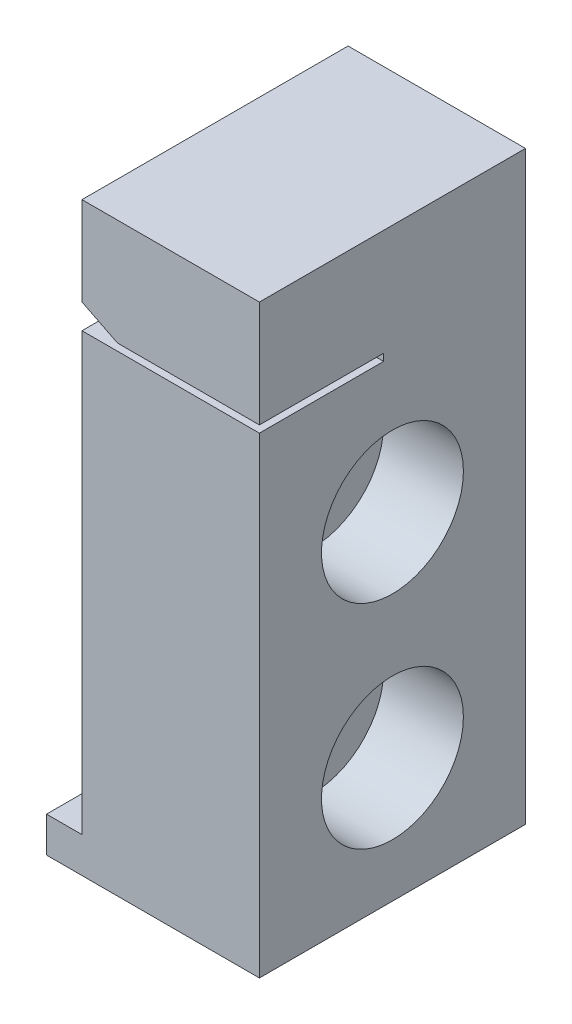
ISO-10303-21;
HEADER;
FILE_DESCRIPTION(('STEP AP214'),'2;1');
FILE_NAME('part.step','',(''),(''),'','','');
FILE_SCHEMA(('AUTOMOTIVE_DESIGN { 1 0 10303 214 1 1 1 1 }'));
ENDSEC;
DATA;
#1=APPLICATION_CONTEXT('core data for automotive mechanical design processes');
#2=APPLICATION_PROTOCOL_DEFINITION('international standard','automotive_design',2000,#1);
#3=PRODUCT_CONTEXT('',#1,'mechanical');
#4=PRODUCT('Part','Part','',(#3));
#5=PRODUCT_RELATED_PRODUCT_CATEGORY('part','',(#4));
#6=PRODUCT_DEFINITION_FORMATION('','',#4);
#7=PRODUCT_DEFINITION_CONTEXT('part definition',#1,'design');
#8=PRODUCT_DEFINITION('design','',#6,#7);
#9=PRODUCT_DEFINITION_SHAPE('','',#8);
#10=(LENGTH_UNIT() NAMED_UNIT(*) SI_UNIT(.MILLI.,.METRE.));
#11=(NAMED_UNIT(*) PLANE_ANGLE_UNIT() SI_UNIT($,.RADIAN.));
#12=(NAMED_UNIT(*) SI_UNIT($,.STERADIAN.) SOLID_ANGLE_UNIT());
#13=UNCERTAINTY_MEASURE_WITH_UNIT(LENGTH_MEASURE(1.E-05),#10,'distance_accuracy_value','');
#14=(GEOMETRIC_REPRESENTATION_CONTEXT(3) GLOBAL_UNCERTAINTY_ASSIGNED_CONTEXT((#13)) GLOBAL_UNIT_ASSIGNED_CONTEXT((#10,
#11,#12)) REPRESENTATION_CONTEXT('',''));
#15=CARTESIAN_POINT('',(0.,0.,0.));
#16=DIRECTION('',(0.,0.,1.));
#17=DIRECTION('',(1.,0.,0.));
#18=AXIS2_PLACEMENT_3D('',#15,#16,#17);
#19=CARTESIAN_POINT('',(0.,19.,7.5));
#20=DIRECTION('',(1.,0.,0.));
#21=DIRECTION('',(0.,0.,-1.));
#22=AXIS2_PLACEMENT_3D('',#19,#20,#21);
#23=CYLINDRICAL_SURFACE('',#22,2.25);
#24=CARTESIAN_POINT('',(2.,19.,7.5));
#25=DIRECTION('',(1.,0.,0.));
#26=DIRECTION('',(0.,0.,-1.));
#27=AXIS2_PLACEMENT_3D('',#24,#25,#26);
#28=CIRCLE('',#27,2.25);
#29=CARTESIAN_POINT('',(2.,19.,5.25));
#30=VERTEX_POINT('',#29);
#31=EDGE_CURVE('E160',#30,#30,#28,.T.);
#32=ORIENTED_EDGE('',*,*,#31,.F.);
#33=EDGE_LOOP('',(#32));
#34=FACE_BOUND('',#33,.T.);
#35=CARTESIAN_POINT('',(7.5,19.,7.5));
#36=DIRECTION('',(1.,0.,0.));
#37=DIRECTION('',(0.,0.,-1.));
#38=AXIS2_PLACEMENT_3D('',#35,#36,#37);
#39=CIRCLE('',#38,2.25);
#40=CARTESIAN_POINT('',(7.5,19.,5.25));
#41=VERTEX_POINT('',#40);
#42=EDGE_CURVE('E37',#41,#41,#39,.F.);
#43=ORIENTED_EDGE('',*,*,#42,.F.);
#44=EDGE_LOOP('',(#43));
#45=FACE_BOUND('',#44,.T.);
#46=ADVANCED_FACE('F33',(#34,#45),#23,.F.);
#47=CARTESIAN_POINT('',(0.,7.,7.5));
#48=DIRECTION('',(1.,0.,0.));
#49=DIRECTION('',(0.,0.,-1.));
#50=AXIS2_PLACEMENT_3D('',#47,#48,#49);
#51=CYLINDRICAL_SURFACE('',#50,2.25);
#52=CARTESIAN_POINT('',(2.,7.,7.5));
#53=DIRECTION('',(1.,0.,0.));
#54=DIRECTION('',(0.,0.,-1.));
#55=AXIS2_PLACEMENT_3D('',#52,#53,#54);
#56=CIRCLE('',#55,2.25);
#57=CARTESIAN_POINT('',(2.,7.,5.25));
#58=VERTEX_POINT('',#57);
#59=EDGE_CURVE('E141',#58,#58,#56,.T.);
#60=ORIENTED_EDGE('',*,*,#59,.F.);
#61=EDGE_LOOP('',(#60));
#62=FACE_BOUND('',#61,.T.);
#63=CARTESIAN_POINT('',(7.5,7.,7.5));
#64=DIRECTION('',(1.,0.,0.));
#65=DIRECTION('',(0.,0.,-1.));
#66=AXIS2_PLACEMENT_3D('',#63,#64,#65);
#67=CIRCLE('',#66,2.25);
#68=CARTESIAN_POINT('',(7.5,7.,5.25));
#69=VERTEX_POINT('',#68);
#70=EDGE_CURVE('E165',#69,#69,#67,.F.);
#71=ORIENTED_EDGE('',*,*,#70,.F.);
#72=EDGE_LOOP('',(#71));
#73=FACE_BOUND('',#72,.T.);
#74=ADVANCED_FACE('F257',(#62,#73),#51,.F.);
#75=CARTESIAN_POINT('',(12.,0.,15.));
#76=DIRECTION('',(-1.,0.,0.));
#77=DIRECTION('',(0.,0.,1.));
#78=AXIS2_PLACEMENT_3D('',#75,#76,#77);
#79=PLANE('',#78);
#80=CARTESIAN_POINT('',(12.,19.,7.5));
#81=DIRECTION('',(1.,0.,0.));
#82=DIRECTION('',(0.,0.,-1.));
#83=AXIS2_PLACEMENT_3D('',#80,#81,#82);
#84=CIRCLE('',#83,4.);
#85=CARTESIAN_POINT('',(12.,19.,3.5));
#86=VERTEX_POINT('',#85);
#87=EDGE_CURVE('E181',#86,#86,#84,.T.);
#88=ORIENTED_EDGE('',*,*,#87,.F.);
#89=EDGE_LOOP('',(#88));
#90=FACE_BOUND('',#89,.T.);
#91=CARTESIAN_POINT('',(12.,7.,7.5));
#92=DIRECTION('',(1.,0.,0.));
#93=DIRECTION('',(0.,0.,-1.));
#94=AXIS2_PLACEMENT_3D('',#91,#92,#93);
#95=CIRCLE('',#94,4.);
#96=CARTESIAN_POINT('',(12.,7.,3.5));
#97=VERTEX_POINT('',#96);
#98=EDGE_CURVE('E174',#97,#97,#95,.T.);
#99=ORIENTED_EDGE('',*,*,#98,.F.);
#100=EDGE_LOOP('',(#99));
#101=FACE_BOUND('',#100,.T.);
#102=DIRECTION('',(0.,0.,1.));
#103=VECTOR('',#102,1.);
#104=CARTESIAN_POINT('',(12.,26.6,15.));
#105=LINE('',#104,#103);
#106=CARTESIAN_POINT('',(12.,26.6,8.00000000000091));
#107=VERTEX_POINT('',#106);
#108=CARTESIAN_POINT('',(12.,26.6,15.));
#109=VERTEX_POINT('',#108);
#110=EDGE_CURVE('E186',#107,#109,#105,.T.);
#111=ORIENTED_EDGE('',*,*,#110,.T.);
#112=DIRECTION('',(0.,1.,0.));
#113=VECTOR('',#112,1.);
#114=CARTESIAN_POINT('',(12.,0.,15.));
#115=LINE('',#114,#113);
#116=CARTESIAN_POINT('',(12.,0.,15.));
#117=VERTEX_POINT('',#116);
#118=EDGE_CURVE('E113',#117,#109,#115,.T.);
#119=ORIENTED_EDGE('',*,*,#118,.F.);
#120=DIRECTION('',(0.,0.,-1.));
#121=VECTOR('',#120,1.);
#122=CARTESIAN_POINT('',(12.,0.,15.));
#123=LINE('',#122,#121);
#124=CARTESIAN_POINT('',(12.,0.,0.));
#125=VERTEX_POINT('',#124);
#126=EDGE_CURVE('E125',#117,#125,#123,.T.);
#127=ORIENTED_EDGE('',*,*,#126,.T.);
#128=DIRECTION('',(0.,1.,0.));
#129=VECTOR('',#128,1.);
#130=CARTESIAN_POINT('',(12.,0.,0.));
#131=LINE('',#130,#129);
#132=CARTESIAN_POINT('',(12.,33.,0.));
#133=VERTEX_POINT('',#132);
#134=EDGE_CURVE('E122',#125,#133,#131,.T.);
#135=ORIENTED_EDGE('',*,*,#134,.T.);
#136=DIRECTION('',(0.,0.,-1.));
#137=VECTOR('',#136,1.);
#138=CARTESIAN_POINT('',(12.,33.,15.));
#139=LINE('',#138,#137);
#140=CARTESIAN_POINT('',(12.,33.,15.));
#141=VERTEX_POINT('',#140);
#142=EDGE_CURVE('E117',#141,#133,#139,.T.);
#143=ORIENTED_EDGE('',*,*,#142,.F.);
#144=CARTESIAN_POINT('',(12.,27.,15.));
#145=VERTEX_POINT('',#144);
#146=EDGE_CURVE('E104',#145,#141,#115,.T.);
#147=ORIENTED_EDGE('',*,*,#146,.F.);
#148=DIRECTION('',(0.,0.,-1.));
#149=VECTOR('',#148,1.);
#150=CARTESIAN_POINT('',(12.,27.,15.));
#151=LINE('',#150,#149);
#152=CARTESIAN_POINT('',(12.,27.,8.));
#153=VERTEX_POINT('',#152);
#154=EDGE_CURVE('E167',#145,#153,#151,.T.);
#155=ORIENTED_EDGE('',*,*,#154,.T.);
#156=DIRECTION('',(0.,-1.,2.27248775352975E-12));
#157=VECTOR('',#156,1.);
#158=CARTESIAN_POINT('',(12.,26.6,8.00000000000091));
#159=LINE('',#158,#157);
#160=EDGE_CURVE('E171',#153,#107,#159,.T.);
#161=ORIENTED_EDGE('',*,*,#160,.T.);
#162=EDGE_LOOP('',(#111,#119,#127,#135,#143,#147,#155,#161));
#163=FACE_BOUND('',#162,.T.);
#164=ADVANCED_FACE('F119',(#90,#101,#163),#79,.F.);
#165=CARTESIAN_POINT('',(2.,2.,15.));
#166=DIRECTION('',(1.,0.,0.));
#167=DIRECTION('',(0.,0.,-1.));
#168=AXIS2_PLACEMENT_3D('',#165,#166,#167);
#169=PLANE('',#168);
#170=ORIENTED_EDGE('',*,*,#59,.T.);
#171=EDGE_LOOP('',(#170));
#172=FACE_BOUND('',#171,.T.);
#173=ORIENTED_EDGE('',*,*,#31,.T.);
#174=EDGE_LOOP('',(#173));
#175=FACE_BOUND('',#174,.T.);
#176=DIRECTION('',(0.,-1.,2.27248775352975E-12));
#177=VECTOR('',#176,1.);
#178=CARTESIAN_POINT('',(2.,1.99999999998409,8.00000000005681));
#179=LINE('',#178,#177);
#180=CARTESIAN_POINT('',(2.,28.,7.99999999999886));
#181=VERTEX_POINT('',#180);
#182=CARTESIAN_POINT('',(2.,26.6,8.00000000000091));
#183=VERTEX_POINT('',#182);
#184=EDGE_CURVE('E12',#181,#183,#179,.T.);
#185=ORIENTED_EDGE('',*,*,#184,.F.);
#186=DIRECTION('',(0.,0.,1.));
#187=VECTOR('',#186,1.);
#188=CARTESIAN_POINT('',(2.,28.,5.76393202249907));
#189=LINE('',#188,#187);
#190=CARTESIAN_POINT('',(2.,28.,15.));
#191=VERTEX_POINT('',#190);
#192=EDGE_CURVE('E232',#181,#191,#189,.T.);
#193=ORIENTED_EDGE('',*,*,#192,.T.);
#194=DIRECTION('',(0.,-1.,0.));
#195=VECTOR('',#194,1.);
#196=CARTESIAN_POINT('',(2.,2.,15.));
#197=LINE('',#196,#195);
#198=CARTESIAN_POINT('',(2.,33.,15.));
#199=VERTEX_POINT('',#198);
#200=EDGE_CURVE('E131',#199,#191,#197,.T.);
#201=ORIENTED_EDGE('',*,*,#200,.F.);
#202=DIRECTION('',(0.,0.,-1.));
#203=VECTOR('',#202,1.);
#204=CARTESIAN_POINT('',(2.,33.,15.));
#205=LINE('',#204,#203);
#206=CARTESIAN_POINT('',(2.,33.,0.));
#207=VERTEX_POINT('',#206);
#208=EDGE_CURVE('E126',#199,#207,#205,.T.);
#209=ORIENTED_EDGE('',*,*,#208,.T.);
#210=DIRECTION('',(0.,-1.,0.));
#211=VECTOR('',#210,1.);
#212=CARTESIAN_POINT('',(2.,2.,0.));
#213=LINE('',#212,#211);
#214=CARTESIAN_POINT('',(2.,2.,0.));
#215=VERTEX_POINT('',#214);
#216=EDGE_CURVE('E87',#207,#215,#213,.T.);
#217=ORIENTED_EDGE('',*,*,#216,.T.);
#218=DIRECTION('',(0.,0.,-1.));
#219=VECTOR('',#218,1.);
#220=CARTESIAN_POINT('',(2.,2.,15.));
#221=LINE('',#220,#219);
#222=CARTESIAN_POINT('',(2.,2.,15.));
#223=VERTEX_POINT('',#222);
#224=EDGE_CURVE('E136',#223,#215,#221,.T.);
#225=ORIENTED_EDGE('',*,*,#224,.F.);
#226=CARTESIAN_POINT('',(2.,26.6,15.));
#227=VERTEX_POINT('',#226);
#228=EDGE_CURVE('E59',#227,#223,#197,.T.);
#229=ORIENTED_EDGE('',*,*,#228,.F.);
#230=DIRECTION('',(0.,0.,1.));
#231=VECTOR('',#230,1.);
#232=CARTESIAN_POINT('',(2.,26.6,15.));
#233=LINE('',#232,#231);
#234=EDGE_CURVE('E163',#183,#227,#233,.T.);
#235=ORIENTED_EDGE('',*,*,#234,.F.);
#236=EDGE_LOOP('',(#185,#193,#201,#209,#217,#225,#229,#235));
#237=FACE_BOUND('',#236,.T.);
#238=ADVANCED_FACE('F230',(#172,#175,#237),#169,.F.);
#239=CARTESIAN_POINT('',(2.,2.,15.));
#240=DIRECTION('',(0.,0.,1.));
#241=DIRECTION('',(1.,0.,0.));
#242=AXIS2_PLACEMENT_3D('',#239,#240,#241);
#243=PLANE('',#242);
#244=ORIENTED_EDGE('',*,*,#118,.T.);
#245=DIRECTION('',(-1.,0.,0.));
#246=VECTOR('',#245,1.);
#247=CARTESIAN_POINT('',(2.,26.6,15.));
#248=LINE('',#247,#246);
#249=EDGE_CURVE('E42',#109,#227,#248,.T.);
#250=ORIENTED_EDGE('',*,*,#249,.T.);
#251=ORIENTED_EDGE('',*,*,#228,.T.);
#252=DIRECTION('',(-1.,0.,0.));
#253=VECTOR('',#252,1.);
#254=CARTESIAN_POINT('',(0.,2.,15.));
#255=LINE('',#254,#253);
#256=CARTESIAN_POINT('',(0.,2.,15.));
#257=VERTEX_POINT('',#256);
#258=EDGE_CURVE('E149',#223,#257,#255,.T.);
#259=ORIENTED_EDGE('',*,*,#258,.T.);
#260=DIRECTION('',(0.,-1.,0.));
#261=VECTOR('',#260,1.);
#262=CARTESIAN_POINT('',(0.,0.,15.));
#263=LINE('',#262,#261);
#264=CARTESIAN_POINT('',(0.,0.,15.));
#265=VERTEX_POINT('',#264);
#266=EDGE_CURVE('E96',#257,#265,#263,.T.);
#267=ORIENTED_EDGE('',*,*,#266,.T.);
#268=DIRECTION('',(1.,0.,0.));
#269=VECTOR('',#268,1.);
#270=CARTESIAN_POINT('',(0.,0.,15.));
#271=LINE('',#270,#269);
#272=EDGE_CURVE('E114',#265,#117,#271,.T.);
#273=ORIENTED_EDGE('',*,*,#272,.T.);
#274=EDGE_LOOP('',(#244,#250,#251,#259,#267,#273));
#275=FACE_BOUND('',#274,.T.);
#276=ADVANCED_FACE('F199',(#275),#243,.T.);
#277=DIRECTION('',(-0.894427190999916,0.447213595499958,0.));
#278=VECTOR('',#277,1.);
#279=CARTESIAN_POINT('',(2.,28.,15.));
#280=LINE('',#279,#278);
#281=CARTESIAN_POINT('',(4.,27.,15.));
#282=VERTEX_POINT('',#281);
#283=EDGE_CURVE('E239',#282,#191,#280,.T.);
#284=ORIENTED_EDGE('',*,*,#283,.F.);
#285=DIRECTION('',(1.,0.,0.));
#286=VECTOR('',#285,1.);
#287=CARTESIAN_POINT('',(2.,27.,15.));
#288=LINE('',#287,#286);
#289=EDGE_CURVE('E50',#282,#145,#288,.T.);
#290=ORIENTED_EDGE('',*,*,#289,.T.);
#291=ORIENTED_EDGE('',*,*,#146,.T.);
#292=DIRECTION('',(-1.,0.,0.));
#293=VECTOR('',#292,1.);
#294=CARTESIAN_POINT('',(2.,33.,15.));
#295=LINE('',#294,#293);
#296=EDGE_CURVE('E109',#141,#199,#295,.T.);
#297=ORIENTED_EDGE('',*,*,#296,.T.);
#298=ORIENTED_EDGE('',*,*,#200,.T.);
#299=EDGE_LOOP('',(#284,#290,#291,#297,#298));
#300=FACE_BOUND('',#299,.T.);
#301=ADVANCED_FACE('F106',(#300),#243,.T.);
#302=CARTESIAN_POINT('',(0.,2.,15.));
#303=DIRECTION('',(0.,-1.,0.));
#304=DIRECTION('',(0.,0.,-1.));
#305=AXIS2_PLACEMENT_3D('',#302,#303,#304);
#306=PLANE('',#305);
#307=DIRECTION('',(-1.,0.,0.));
#308=VECTOR('',#307,1.);
#309=CARTESIAN_POINT('',(0.,2.,0.));
#310=LINE('',#309,#308);
#311=CARTESIAN_POINT('',(0.,2.,0.));
#312=VERTEX_POINT('',#311);
#313=EDGE_CURVE('E137',#215,#312,#310,.T.);
#314=ORIENTED_EDGE('',*,*,#313,.T.);
#315=DIRECTION('',(0.,0.,-1.));
#316=VECTOR('',#315,1.);
#317=CARTESIAN_POINT('',(0.,2.,15.));
#318=LINE('',#317,#316);
#319=EDGE_CURVE('E156',#257,#312,#318,.T.);
#320=ORIENTED_EDGE('',*,*,#319,.F.);
#321=ORIENTED_EDGE('',*,*,#258,.F.);
#322=ORIENTED_EDGE('',*,*,#224,.T.);
#323=EDGE_LOOP('',(#314,#320,#321,#322));
#324=FACE_BOUND('',#323,.T.);
#325=ADVANCED_FACE('F35',(#324),#306,.F.);
#326=CARTESIAN_POINT('',(0.,0.,15.));
#327=DIRECTION('',(1.,0.,0.));
#328=DIRECTION('',(0.,0.,-1.));
#329=AXIS2_PLACEMENT_3D('',#326,#327,#328);
#330=PLANE('',#329);
#331=DIRECTION('',(0.,-1.,0.));
#332=VECTOR('',#331,1.);
#333=CARTESIAN_POINT('',(0.,0.,0.));
#334=LINE('',#333,#332);
#335=CARTESIAN_POINT('',(0.,0.,0.));
#336=VERTEX_POINT('',#335);
#337=EDGE_CURVE('E140',#312,#336,#334,.T.);
#338=ORIENTED_EDGE('',*,*,#337,.T.);
#339=DIRECTION('',(0.,0.,-1.));
#340=VECTOR('',#339,1.);
#341=CARTESIAN_POINT('',(0.,0.,15.));
#342=LINE('',#341,#340);
#343=EDGE_CURVE('E153',#265,#336,#342,.T.);
#344=ORIENTED_EDGE('',*,*,#343,.F.);
#345=ORIENTED_EDGE('',*,*,#266,.F.);
#346=ORIENTED_EDGE('',*,*,#319,.T.);
#347=EDGE_LOOP('',(#338,#344,#345,#346));
#348=FACE_BOUND('',#347,.T.);
#349=ADVANCED_FACE('F300',(#348),#330,.F.);
#350=CARTESIAN_POINT('',(0.,0.,15.));
#351=DIRECTION('',(0.,1.,0.));
#352=DIRECTION('',(0.,0.,1.));
#353=AXIS2_PLACEMENT_3D('',#350,#351,#352);
#354=PLANE('',#353);
#355=DIRECTION('',(1.,0.,0.));
#356=VECTOR('',#355,1.);
#357=CARTESIAN_POINT('',(0.,0.,0.));
#358=LINE('',#357,#356);
#359=EDGE_CURVE('E143',#336,#125,#358,.T.);
#360=ORIENTED_EDGE('',*,*,#359,.T.);
#361=ORIENTED_EDGE('',*,*,#126,.F.);
#362=ORIENTED_EDGE('',*,*,#272,.F.);
#363=ORIENTED_EDGE('',*,*,#343,.T.);
#364=EDGE_LOOP('',(#360,#361,#362,#363));
#365=FACE_BOUND('',#364,.T.);
#366=ADVANCED_FACE('F203',(#365),#354,.F.);
#367=CARTESIAN_POINT('',(2.,33.,15.));
#368=DIRECTION('',(0.,-1.,0.));
#369=DIRECTION('',(0.,0.,-1.));
#370=AXIS2_PLACEMENT_3D('',#367,#368,#369);
#371=PLANE('',#370);
#372=DIRECTION('',(-1.,0.,0.));
#373=VECTOR('',#372,1.);
#374=CARTESIAN_POINT('',(2.,33.,0.));
#375=LINE('',#374,#373);
#376=EDGE_CURVE('E146',#133,#207,#375,.T.);
#377=ORIENTED_EDGE('',*,*,#376,.T.);
#378=ORIENTED_EDGE('',*,*,#208,.F.);
#379=ORIENTED_EDGE('',*,*,#296,.F.);
#380=ORIENTED_EDGE('',*,*,#142,.T.);
#381=EDGE_LOOP('',(#377,#378,#379,#380));
#382=FACE_BOUND('',#381,.T.);
#383=ADVANCED_FACE('F128',(#382),#371,.F.);
#384=CARTESIAN_POINT('',(2.,2.,0.));
#385=DIRECTION('',(0.,0.,1.));
#386=DIRECTION('',(1.,0.,0.));
#387=AXIS2_PLACEMENT_3D('',#384,#385,#386);
#388=PLANE('',#387);
#389=ORIENTED_EDGE('',*,*,#313,.F.);
#390=ORIENTED_EDGE('',*,*,#216,.F.);
#391=ORIENTED_EDGE('',*,*,#376,.F.);
#392=ORIENTED_EDGE('',*,*,#134,.F.);
#393=ORIENTED_EDGE('',*,*,#359,.F.);
#394=ORIENTED_EDGE('',*,*,#337,.F.);
#395=EDGE_LOOP('',(#389,#390,#391,#392,#393,#394));
#396=FACE_BOUND('',#395,.T.);
#397=ADVANCED_FACE('F290',(#396),#388,.F.);
#398=CARTESIAN_POINT('',(0.,26.6,8.00000000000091));
#399=DIRECTION('',(0.,2.27248775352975E-12,1.));
#400=DIRECTION('',(0.,-1.,2.27248775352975E-12));
#401=AXIS2_PLACEMENT_3D('',#398,#399,#400);
#402=PLANE('',#401);
#403=ORIENTED_EDGE('',*,*,#184,.T.);
#404=DIRECTION('',(1.,0.,0.));
#405=VECTOR('',#404,1.);
#406=CARTESIAN_POINT('',(0.,26.6,8.00000000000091));
#407=LINE('',#406,#405);
#408=EDGE_CURVE('E189',#183,#107,#407,.T.);
#409=ORIENTED_EDGE('',*,*,#408,.T.);
#410=ORIENTED_EDGE('',*,*,#160,.F.);
#411=DIRECTION('',(1.,0.,0.));
#412=VECTOR('',#411,1.);
#413=CARTESIAN_POINT('',(0.,27.,8.));
#414=LINE('',#413,#412);
#415=CARTESIAN_POINT('',(4.,27.,8.));
#416=VERTEX_POINT('',#415);
#417=EDGE_CURVE('E188',#416,#153,#414,.T.);
#418=ORIENTED_EDGE('',*,*,#417,.F.);
#419=DIRECTION('',(0.894427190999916,-0.447213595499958,1.01628741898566E-12));
#420=VECTOR('',#419,1.);
#421=CARTESIAN_POINT('',(1.99999999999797,28.000000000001,7.99999999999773));
#422=LINE('',#421,#420);
#423=EDGE_CURVE('E227',#181,#416,#422,.T.);
#424=ORIENTED_EDGE('',*,*,#423,.F.);
#425=EDGE_LOOP('',(#403,#409,#410,#418,#424));
#426=FACE_BOUND('',#425,.T.);
#427=ADVANCED_FACE('F223',(#426),#402,.T.);
#428=CARTESIAN_POINT('',(0.,26.6,15.));
#429=DIRECTION('',(0.,1.,0.));
#430=DIRECTION('',(0.,0.,1.));
#431=AXIS2_PLACEMENT_3D('',#428,#429,#430);
#432=PLANE('',#431);
#433=ORIENTED_EDGE('',*,*,#234,.T.);
#434=ORIENTED_EDGE('',*,*,#249,.F.);
#435=ORIENTED_EDGE('',*,*,#110,.F.);
#436=ORIENTED_EDGE('',*,*,#408,.F.);
#437=EDGE_LOOP('',(#433,#434,#435,#436));
#438=FACE_BOUND('',#437,.T.);
#439=ADVANCED_FACE('F213',(#438),#432,.T.);
#440=CARTESIAN_POINT('',(0.,27.,15.));
#441=DIRECTION('',(0.,-1.,0.));
#442=DIRECTION('',(0.,0.,-1.));
#443=AXIS2_PLACEMENT_3D('',#440,#441,#442);
#444=PLANE('',#443);
#445=DIRECTION('',(0.,0.,1.));
#446=VECTOR('',#445,1.);
#447=CARTESIAN_POINT('',(4.,27.,5.76393202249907));
#448=LINE('',#447,#446);
#449=EDGE_CURVE('E240',#416,#282,#448,.T.);
#450=ORIENTED_EDGE('',*,*,#449,.F.);
#451=ORIENTED_EDGE('',*,*,#417,.T.);
#452=ORIENTED_EDGE('',*,*,#154,.F.);
#453=ORIENTED_EDGE('',*,*,#289,.F.);
#454=EDGE_LOOP('',(#450,#451,#452,#453));
#455=FACE_BOUND('',#454,.T.);
#456=ADVANCED_FACE('F272',(#455),#444,.T.);
#457=CARTESIAN_POINT('',(7.5,7.,7.5));
#458=DIRECTION('',(1.,0.,0.));
#459=DIRECTION('',(0.,0.,-1.));
#460=AXIS2_PLACEMENT_3D('',#457,#458,#459);
#461=PLANE('',#460);
#462=CARTESIAN_POINT('',(7.5,7.,7.5));
#463=DIRECTION('',(1.,0.,0.));
#464=DIRECTION('',(0.,0.,-1.));
#465=AXIS2_PLACEMENT_3D('',#462,#463,#464);
#466=CIRCLE('',#465,4.);
#467=CARTESIAN_POINT('',(7.5,7.,3.5));
#468=VERTEX_POINT('',#467);
#469=EDGE_CURVE('E168',#468,#468,#466,.T.);
#470=ORIENTED_EDGE('',*,*,#469,.T.);
#471=EDGE_LOOP('',(#470));
#472=FACE_BOUND('',#471,.T.);
#473=ORIENTED_EDGE('',*,*,#70,.T.);
#474=EDGE_LOOP('',(#473));
#475=FACE_BOUND('',#474,.T.);
#476=ADVANCED_FACE('F264',(#472,#475),#461,.T.);
#477=CARTESIAN_POINT('',(7.5,7.,7.5));
#478=DIRECTION('',(1.,0.,0.));
#479=DIRECTION('',(0.,0.,-1.));
#480=AXIS2_PLACEMENT_3D('',#477,#478,#479);
#481=CYLINDRICAL_SURFACE('',#480,4.);
#482=ORIENTED_EDGE('',*,*,#469,.F.);
#483=EDGE_LOOP('',(#482));
#484=FACE_BOUND('',#483,.T.);
#485=ORIENTED_EDGE('',*,*,#98,.T.);
#486=EDGE_LOOP('',(#485));
#487=FACE_BOUND('',#486,.T.);
#488=ADVANCED_FACE('F261',(#484,#487),#481,.F.);
#489=CARTESIAN_POINT('',(7.5,19.,7.5));
#490=DIRECTION('',(1.,0.,0.));
#491=DIRECTION('',(0.,0.,-1.));
#492=AXIS2_PLACEMENT_3D('',#489,#490,#491);
#493=PLANE('',#492);
#494=CARTESIAN_POINT('',(7.5,19.,7.5));
#495=DIRECTION('',(1.,0.,0.));
#496=DIRECTION('',(0.,0.,-1.));
#497=AXIS2_PLACEMENT_3D('',#494,#495,#496);
#498=CIRCLE('',#497,4.);
#499=CARTESIAN_POINT('',(7.5,19.,3.5));
#500=VERTEX_POINT('',#499);
#501=EDGE_CURVE('E245',#500,#500,#498,.T.);
#502=ORIENTED_EDGE('',*,*,#501,.T.);
#503=EDGE_LOOP('',(#502));
#504=FACE_BOUND('',#503,.T.);
#505=ORIENTED_EDGE('',*,*,#42,.T.);
#506=EDGE_LOOP('',(#505));
#507=FACE_BOUND('',#506,.T.);
#508=ADVANCED_FACE('F263',(#504,#507),#493,.T.);
#509=CARTESIAN_POINT('',(7.5,19.,7.5));
#510=DIRECTION('',(1.,0.,0.));
#511=DIRECTION('',(0.,0.,-1.));
#512=AXIS2_PLACEMENT_3D('',#509,#510,#511);
#513=CYLINDRICAL_SURFACE('',#512,4.);
#514=ORIENTED_EDGE('',*,*,#501,.F.);
#515=EDGE_LOOP('',(#514));
#516=FACE_BOUND('',#515,.T.);
#517=ORIENTED_EDGE('',*,*,#87,.T.);
#518=EDGE_LOOP('',(#517));
#519=FACE_BOUND('',#518,.T.);
#520=ADVANCED_FACE('F253',(#516,#519),#513,.F.);
#521=CARTESIAN_POINT('',(2.,28.,5.76393202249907));
#522=DIRECTION('',(0.447213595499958,0.894427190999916,0.));
#523=DIRECTION('',(-0.894427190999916,0.447213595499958,0.));
#524=AXIS2_PLACEMENT_3D('',#521,#522,#523);
#525=PLANE('',#524);
#526=ORIENTED_EDGE('',*,*,#423,.T.);
#527=ORIENTED_EDGE('',*,*,#449,.T.);
#528=ORIENTED_EDGE('',*,*,#283,.T.);
#529=ORIENTED_EDGE('',*,*,#192,.F.);
#530=EDGE_LOOP('',(#526,#527,#528,#529));
#531=FACE_BOUND('',#530,.T.);
#532=ADVANCED_FACE('F236',(#531),#525,.F.);
#533=CLOSED_SHELL('',(#46,#74,#164,#238,#276,#301,#325,#349,#366,#383,#397,#427,#439,#456,#476,
#488,#508,#520,#532));
#534=MANIFOLD_SOLID_BREP('B2',#533);
#535=ADVANCED_BREP_SHAPE_REPRESENTATION('',(#18,#534),#14);
#536=SHAPE_DEFINITION_REPRESENTATION(#9,#535);
ENDSEC;
END-ISO-10303-21;
